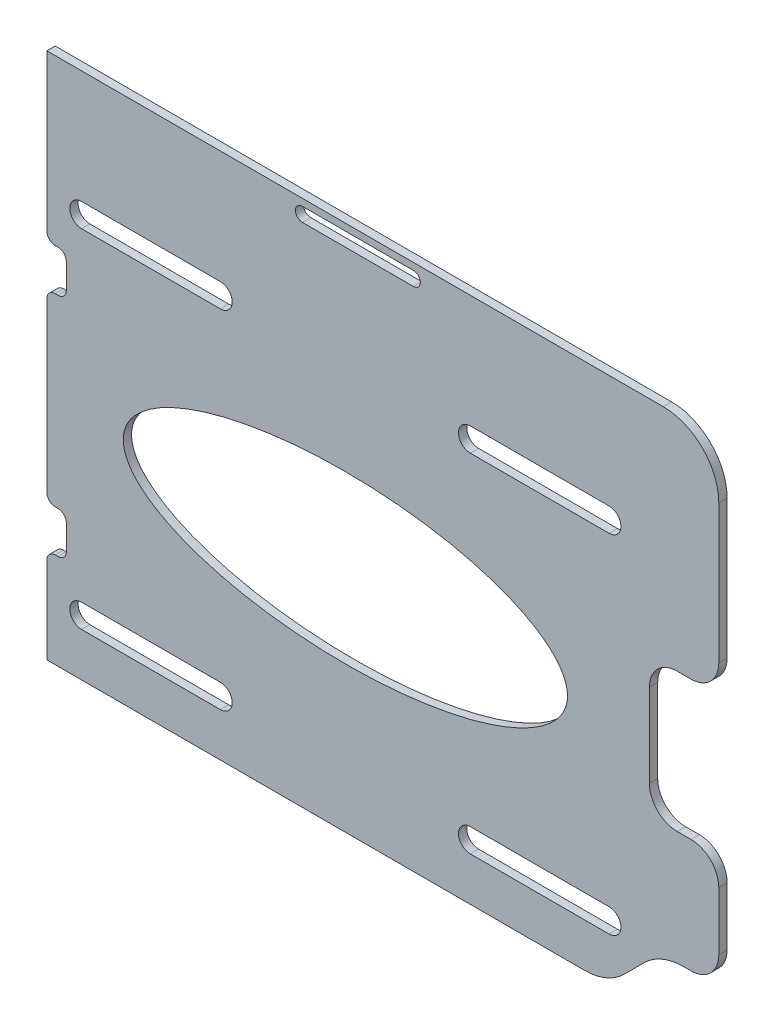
from build123d import *

# Parameters (mm, degrees)
ESQUISSE1_RX         = 80
ESQUISSE1_RY         = 30
BASE_EXTRUSION_DEPTH = 3


with BuildPart() as part:
    # Esquisse1 → Base-Extrusion (new body)
    with BuildSketch(Plane.XY):
        with BuildLine():
            Line((114.5, 107.5), (-107.5, 107.5))
            Line((-107.5, 107.5), (-107.5, 51.25))
            ThreePointArc((-107.5, 51.25), (-106.621320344, 49.128679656), (-104.5, 48.25))
            Line((-104.5, 48.25), (-103.5, 48.25))
            ThreePointArc((-103.5, 48.25), (-101.378679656, 47.371320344), (-100.5, 45.25))
            Line((-100.5, 45.25), (-100.5, 36.25))
            ThreePointArc((-100.5, 36.25), (-101.378679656, 34.128679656), (-103.5, 33.25))
            Line((-103.5, 33.25), (-104.5, 33.25))
            ThreePointArc((-104.5, 33.25), (-106.621320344, 32.371320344), (-107.5, 30.25))
            Line((-107.5, 30.25), (-107.5, -30.25))
            ThreePointArc((-107.5, -30.25), (-106.621320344, -32.371320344), (-104.5, -33.25))
            Line((-104.5, -33.25), (-103.5, -33.25))
            ThreePointArc((-103.5, -33.25), (-101.378679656, -34.128679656), (-100.5, -36.25))
            Line((-100.5, -36.25), (-100.5, -45.25))
            ThreePointArc((-100.5, -45.25), (-101.378679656, -47.371320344), (-103.5, -48.25))
            Line((-103.5, -48.25), (-104.5, -48.25))
            ThreePointArc((-104.5, -48.25), (-106.621320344, -49.128679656), (-107.5, -51.25))
            Line((-107.5, -51.25), (-107.5, -82.5))
            Line((-107.5, -82.5), (86.215728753, -82.5))
            ThreePointArc((86.215728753, -82.5), (93.8693974, -80.97759065), (100.357864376, -76.642135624))
            Line((100.357864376, -76.642135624), (107.642135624, -69.357864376))
            ThreePointArc((107.642135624, -69.357864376), (114.1306026, -65.02240935), (121.784271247, -63.5))
            Line((121.784271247, -63.5), (124.5, -63.5))
            ThreePointArc((124.5, -63.5), (131.571067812, -60.571067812), (134.5, -53.5))
            Line((134.5, -53.5), (134.5, -32.5))
            ThreePointArc((134.5, -32.5), (131.571067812, -25.428932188), (124.5, -22.5))
            Line((124.5, -22.5), (119.5, -22.5))
            ThreePointArc((119.5, -22.5), (112.428932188, -19.571067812), (109.5, -12.5))
            Line((109.5, -12.5), (109.5, 17.5))
            ThreePointArc((109.5, 17.5), (112.428932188, 24.571067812), (119.5, 27.5))
            Line((119.5, 27.5), (124.5, 27.5))
            ThreePointArc((124.5, 27.5), (131.571067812, 30.428932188), (134.5, 37.5))
            Line((134.5, 37.5), (134.5, 87.5))
            ThreePointArc((134.5, 87.5), (128.642135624, 101.642135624), (114.5, 107.5))
        make_face()
        with Locations(Location((0, 0), (0, 0, 180))):
            Ellipse(ESQUISSE1_RX, ESQUISSE1_RY, mode=Mode.SUBTRACT)
        with BuildLine():
            Line((-95, 66.75), (-45, 66.75))
            ThreePointArc((-45, 66.75), (-40.75, 62.5), (-45, 58.25))
            Line((-45, 58.25), (-95, 58.25))
            ThreePointArc((-95, 58.25), (-99.25, 62.5), (-95, 66.75))
        make_face(mode=Mode.SUBTRACT)
        with BuildLine():
            Line((45, 66.75), (95, 66.75))
            ThreePointArc((95, 66.75), (99.25, 62.5), (95, 58.25))
            Line((95, 58.25), (45, 58.25))
            ThreePointArc((45, 58.25), (40.75, 62.5), (45, 66.75))
        make_face(mode=Mode.SUBTRACT)
        with BuildLine():
            Line((-95, -58.25), (-45, -58.25))
            ThreePointArc((-45, -58.25), (-40.75, -62.5), (-45, -66.75))
            Line((-45, -66.75), (-95, -66.75))
            ThreePointArc((-95, -66.75), (-99.25, -62.5), (-95, -58.25))
        make_face(mode=Mode.SUBTRACT)
        with BuildLine():
            Line((45, -66.75), (95, -66.75))
            ThreePointArc((95, -66.75), (99.25, -62.5), (95, -58.25))
            Line((95, -58.25), (45, -58.25))
            ThreePointArc((45, -58.25), (40.75, -62.5), (45, -66.75))
        make_face(mode=Mode.SUBTRACT)
        with BuildLine():
            Line((-15.5, 100), (24.5, 100))
            ThreePointArc((24.5, 100), (27, 102.5), (24.5, 105))
            Line((24.5, 105), (-15.5, 105))
            ThreePointArc((-15.5, 105), (-18, 102.5), (-15.5, 100))
        make_face(mode=Mode.SUBTRACT)
    extrude(amount=BASE_EXTRUSION_DEPTH)


solid = part.part
